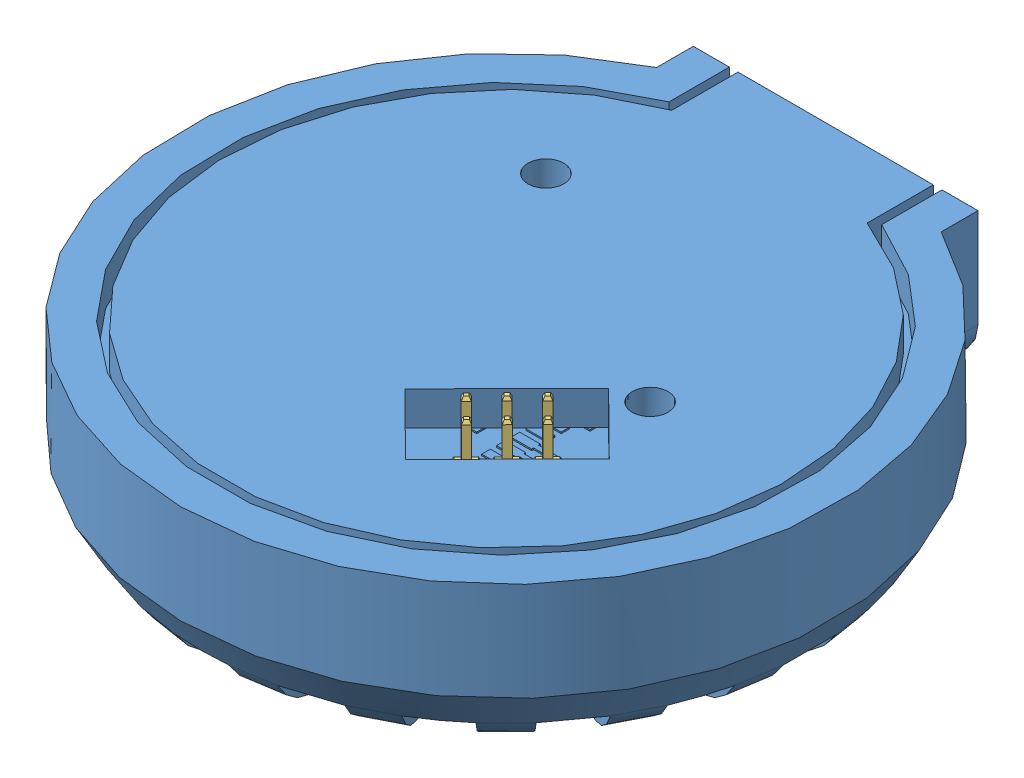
SolidWorks assembly MyProgramer.SLDASM, configuration Default (file format 11000). Lengths in mm.
Overall size (57.4 17.34 58.98).
5 component instances, 3 part files, 21 mates.
Components (placement in the parent):
- Circular Trace-1: Circular Trace.SLDPRT [Lower Case] at origin size (57.4 15.45 57.76)
- Circular Trace-2: Circular Trace.SLDPRT [Default] at origin size (43.18 1.57 49.85)
- Circular Trace-3: Circular Trace.SLDPRT [PlexiCover] at origin size (49.53 3 53.82)
- Mini USB-1: Mini USB.SLDPRT [Default] at (0 0.127 -25.6776) x (0 0 1) z (0 1 0) size (10.5 10.7 3.9)
- 6pinheaderSMD-1: 6pinheaderSMD.SLDPRT [Default] at (7.7098 0.727 12.9842) x (0.703205 0 -0.710987) z (0.710987 0 0.703205) size (7.62 9.04 8.5)
Mates (geometry in assembly coordinates):
- Concentric1: concentric: cylinder of ? through (0 -4.6228 0) axis (0 -1 0) radius 22.352; cylinder of ? through (0 -1.4478 0) axis (0 1 0) radius 21.59
- Coincident1: coincident: plane of ? through (0 -1.4478 0) normal (0 1 0); plane of ? through (0 -1.4478 0) normal (0 -1 0)
- Parallel1: parallel: plane of ? through (0 0 -29.0543) normal (0 0 -1); plane of ? through (5.4356 -1.4478 -28.2606) normal (0 0 -1)
- Concentric2: concentric: cylinder of ? through (0 4.2672 0) axis (0 1 0) radius 25.527; cylinder of ? through (0 80.4091 0) axis (0 -1 0) radius 24.765
- Coincident3: coincident: plane of ? through (0 4.2672 0) normal (0 1 0); plane of ? through (0 4.2672 0) normal (0 -1 0)
- Parallel2: parallel: plane of ? through (0 0 -29.0543) normal (0 0 -1); plane of ? through (-8.6106 80.4091 -29.0543) normal (0 0 -1)
- Concentric3: concentric: cylinder of ? through (12.7 -7.7978 0) axis (0 1 0) radius 1.5875; cylinder of ? through (12.7 -4.6228 0) axis (0 -1 0) radius 1.4224
- Coincident4: coincident: plane of ? through (0 -4.6228 0) normal (0 -1 0); plane of ? through (10.3187 -4.6228 1.3748) normal (0 1 0)
- Parallel3: parallel: plane of ? through (12.7 -7.7978 3.6662) normal (0.5 0 -0.866025); plane of ? through (10.3187 -4.6228 1.3748) normal (-0.5 0 0.866025)
- Concentric41: concentric: cylinder of ? through (-9.3311 -7.7978 -12.8431) axis (0 1 0) radius 1.5875; cylinder of ? through (-9.3311 -6.2103 -12.8431) axis (0 1 0) radius 1.4224
- Coincident51: coincident: plane of ? through (0 -4.6228 0) normal (0 -1 0); plane of ? through (-10.5727 -4.6228 -15.2965) normal (0 1 0)
- Concentric5: concentric: circle of ?; circle of ?
- Coincident6: coincident: plane of ? through (0 7.2672 22.352) normal (0 1 0); plane of ? through (-9.3311 7.2672 -12.8431) normal (0 -1 0)
- Coincident7: coincident: plane of ? through (0 7.2672 22.352) normal (0 1 0); plane of ? through (12.7 7.2672 0) normal (0 -1 0)
- Concentric6: concentric: cylinder of ? through (12.7 80.4091 0) axis (0 -1 0) radius 1.5875; unknown of ?
- Coincident10: coincident: plane of ? through (0 0.127 0) normal (0 1 0); plane of Mini USB-1 through (0 0.127 -25.6776) normal (0 -1 0)
- Width1: width: plane of Mini USB-1 through (-1.85 1.427 -19.7776) normal (-1 0 0); plane of Mini USB-1 through (1.85 1.427 -19.7776) normal (1 0 0); plane of ? through (1.8034 -7.712 -20.4628) normal (1 0 0); plane of ? through (-1.8034 -7.712 -20.4628) normal (-1 0 0)
- Width2: width: plane of Mini USB-1 through (3.85 4.027 -21.0776) normal (0 0 1); plane of Mini USB-1 through (0 0.127 -28.0776) normal (0 0 -1); plane of ? through (5.4356 -1.4478 -28.2606) normal (0 0 -1); plane of ? through (0 3.8777 -20.8946) normal (0 0 1)
- Coincident11: coincident: plane of ? through (0 0.127 0) normal (0 1 0); plane of 6pinheaderSMD-1 through (9.5172 0.127 5.3939) normal (0 -1 0)
- Width3: width: plane of 6pinheaderSMD-1 through (7.7309 -0.171 11.6653) normal (-0.703205 0 0.710987); plane of 6pinheaderSMD-1 through (11.7497 -0.171 7.602) normal (0.703205 0 -0.710987); plane of ? through (2.2416 3.8777 -2.2664) normal (0.703205 0 -0.710987); plane of ? through (-2.2416 3.8777 2.2664) normal (-0.703205 0 0.710987)
- Width4: width: plane of 6pinheaderSMD-1 through (10.0704 0.127 13.0861) normal (0.710987 0 0.703205); plane of 6pinheaderSMD-1 through (4.027 0.127 7.1089) normal (-0.710987 0 -0.703205); plane of ? through (5.7673 3.8777 5.7041) normal (-0.710987 0 -0.703205); plane of ? through (11.4559 3.8777 11.3305) normal (0.710987 0 0.703205)
